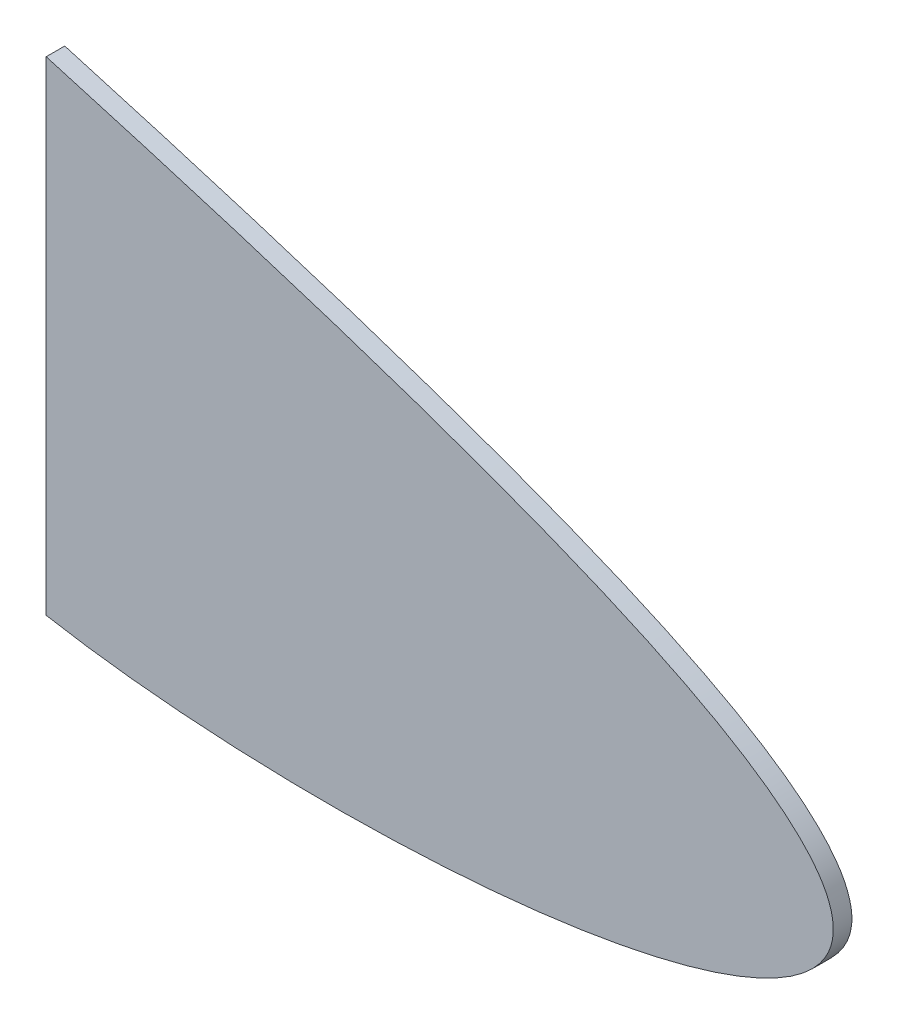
ISO-10303-21;
HEADER;
FILE_DESCRIPTION(('STEP AP214'),'2;1');
FILE_NAME('part.step','',(''),(''),'','','');
FILE_SCHEMA(('AUTOMOTIVE_DESIGN { 1 0 10303 214 1 1 1 1 }'));
ENDSEC;
DATA;
#1=APPLICATION_CONTEXT('core data for automotive mechanical design processes');
#2=APPLICATION_PROTOCOL_DEFINITION('international standard','automotive_design',2000,#1);
#3=PRODUCT_CONTEXT('',#1,'mechanical');
#4=PRODUCT('Part','Part','',(#3));
#5=PRODUCT_RELATED_PRODUCT_CATEGORY('part','',(#4));
#6=PRODUCT_DEFINITION_FORMATION('','',#4);
#7=PRODUCT_DEFINITION_CONTEXT('part definition',#1,'design');
#8=PRODUCT_DEFINITION('design','',#6,#7);
#9=PRODUCT_DEFINITION_SHAPE('','',#8);
#10=(LENGTH_UNIT() NAMED_UNIT(*) SI_UNIT(.MILLI.,.METRE.));
#11=(NAMED_UNIT(*) PLANE_ANGLE_UNIT() SI_UNIT($,.RADIAN.));
#12=(NAMED_UNIT(*) SI_UNIT($,.STERADIAN.) SOLID_ANGLE_UNIT());
#13=UNCERTAINTY_MEASURE_WITH_UNIT(LENGTH_MEASURE(1.E-05),#10,'distance_accuracy_value','');
#14=(GEOMETRIC_REPRESENTATION_CONTEXT(3) GLOBAL_UNCERTAINTY_ASSIGNED_CONTEXT((#13)) GLOBAL_UNIT_ASSIGNED_CONTEXT((#10,
#11,#12)) REPRESENTATION_CONTEXT('',''));
#15=CARTESIAN_POINT('',(0.,0.,0.));
#16=DIRECTION('',(0.,0.,1.));
#17=DIRECTION('',(1.,0.,0.));
#18=AXIS2_PLACEMENT_3D('',#15,#16,#17);
#19=CARTESIAN_POINT('',(10.6379734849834,6.05459948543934,-0.914405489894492));
#20=CARTESIAN_POINT('',(17.6344475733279,4.79148537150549,-0.914405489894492));
#21=CARTESIAN_POINT('',(28.1488490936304,4.79148537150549,-0.914405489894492));
#22=CARTESIAN_POINT('',(40.0870758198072,6.05459948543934,-0.914405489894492));
#23=CARTESIAN_POINT('',(41.9490010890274,10.5963112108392,-0.914405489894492));
#24=CARTESIAN_POINT('',(38.3346755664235,13.9920994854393,-0.914405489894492));
#25=CARTESIAN_POINT('',(10.6379734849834,21.9295994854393,-0.914405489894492));
#26=B_SPLINE_CURVE_WITH_KNOTS('',6,(#19,#20,#21,#22,#23,#24,#25),.UNSPECIFIED.,.F.,.F.,(7,7),
(0.,1.),.UNSPECIFIED.);
#27=DIRECTION('',(0.,0.,1.));
#28=VECTOR('',#27,1.);
#29=SURFACE_OF_LINEAR_EXTRUSION('',#26,#28);
#30=CARTESIAN_POINT('',(10.6379734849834,6.05459948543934,-0.304805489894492));
#31=CARTESIAN_POINT('',(17.6344475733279,4.79148537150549,-0.304805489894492));
#32=CARTESIAN_POINT('',(28.1488490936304,4.79148537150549,-0.304805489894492));
#33=CARTESIAN_POINT('',(40.0870758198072,6.05459948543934,-0.304805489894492));
#34=CARTESIAN_POINT('',(41.9490010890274,10.5963112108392,-0.304805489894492));
#35=CARTESIAN_POINT('',(38.3346755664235,13.9920994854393,-0.304805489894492));
#36=CARTESIAN_POINT('',(10.6379734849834,21.9295994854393,-0.304805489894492));
#37=B_SPLINE_CURVE_WITH_KNOTS('',6,(#30,#31,#32,#33,#34,#35,#36),.UNSPECIFIED.,.F.,.F.,(7,7),
(0.,1.),.UNSPECIFIED.);
#38=CARTESIAN_POINT('',(10.6379734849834,6.05459948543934,-0.304805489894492));
#39=VERTEX_POINT('',#38);
#40=CARTESIAN_POINT('',(10.6379734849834,21.9295994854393,-0.304805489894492));
#41=VERTEX_POINT('',#40);
#42=EDGE_CURVE('E70',#39,#41,#37,.T.);
#43=ORIENTED_EDGE('',*,*,#42,.F.);
#44=DIRECTION('',(0.,0.,1.));
#45=VECTOR('',#44,1.);
#46=CARTESIAN_POINT('',(10.6379734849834,6.05459948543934,-0.914405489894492));
#47=LINE('',#46,#45);
#48=CARTESIAN_POINT('',(10.6379734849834,6.05459948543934,-0.914405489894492));
#49=VERTEX_POINT('',#48);
#50=EDGE_CURVE('E11',#49,#39,#47,.T.);
#51=ORIENTED_EDGE('',*,*,#50,.F.);
#52=CARTESIAN_POINT('',(10.6379734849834,21.9295994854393,-0.914405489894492));
#53=VERTEX_POINT('',#52);
#54=EDGE_CURVE('E74',#49,#53,#26,.T.);
#55=ORIENTED_EDGE('',*,*,#54,.T.);
#56=DIRECTION('',(0.,0.,1.));
#57=VECTOR('',#56,1.);
#58=CARTESIAN_POINT('',(10.6379734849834,21.9295994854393,-0.914405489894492));
#59=LINE('',#58,#57);
#60=EDGE_CURVE('E44',#53,#41,#59,.T.);
#61=ORIENTED_EDGE('',*,*,#60,.T.);
#62=EDGE_LOOP('',(#43,#51,#55,#61));
#63=FACE_BOUND('',#62,.T.);
#64=ADVANCED_FACE('F40',(#63),#29,.T.);
#65=CARTESIAN_POINT('',(10.6379734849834,6.05459948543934,-0.914405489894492));
#66=DIRECTION('',(-1.,0.,0.));
#67=DIRECTION('',(0.,0.,1.));
#68=AXIS2_PLACEMENT_3D('',#65,#66,#67);
#69=PLANE('',#68);
#70=DIRECTION('',(0.,-1.,0.));
#71=VECTOR('',#70,1.);
#72=CARTESIAN_POINT('',(10.6379734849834,6.05459948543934,-0.304805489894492));
#73=LINE('',#72,#71);
#74=EDGE_CURVE('E67',#41,#39,#73,.T.);
#75=ORIENTED_EDGE('',*,*,#74,.F.);
#76=ORIENTED_EDGE('',*,*,#60,.F.);
#77=DIRECTION('',(0.,-1.,0.));
#78=VECTOR('',#77,1.);
#79=CARTESIAN_POINT('',(10.6379734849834,6.05459948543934,-0.914405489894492));
#80=LINE('',#79,#78);
#81=EDGE_CURVE('E69',#53,#49,#80,.T.);
#82=ORIENTED_EDGE('',*,*,#81,.T.);
#83=ORIENTED_EDGE('',*,*,#50,.T.);
#84=EDGE_LOOP('',(#75,#76,#82,#83));
#85=FACE_BOUND('',#84,.T.);
#86=ADVANCED_FACE('F65',(#85),#69,.T.);
#87=CARTESIAN_POINT('',(34.5359367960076,7.69679135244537,-0.914405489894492));
#88=DIRECTION('',(0.,0.,1.));
#89=DIRECTION('',(1.,0.,0.));
#90=AXIS2_PLACEMENT_3D('',#87,#88,#89);
#91=PLANE('',#90);
#92=ORIENTED_EDGE('',*,*,#54,.F.);
#93=ORIENTED_EDGE('',*,*,#81,.F.);
#94=EDGE_LOOP('',(#92,#93));
#95=FACE_BOUND('',#94,.T.);
#96=ADVANCED_FACE('F89',(#95),#91,.F.);
#97=CARTESIAN_POINT('',(34.5359367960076,7.69679135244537,-0.304805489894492));
#98=DIRECTION('',(0.,0.,1.));
#99=DIRECTION('',(1.,0.,0.));
#100=AXIS2_PLACEMENT_3D('',#97,#98,#99);
#101=PLANE('',#100);
#102=ORIENTED_EDGE('',*,*,#42,.T.);
#103=ORIENTED_EDGE('',*,*,#74,.T.);
#104=EDGE_LOOP('',(#102,#103));
#105=FACE_BOUND('',#104,.T.);
#106=ADVANCED_FACE('F73',(#105),#101,.T.);
#107=CLOSED_SHELL('',(#64,#86,#96,#106));
#108=MANIFOLD_SOLID_BREP('B2',#107);
#109=ADVANCED_BREP_SHAPE_REPRESENTATION('',(#18,#108),#14);
#110=SHAPE_DEFINITION_REPRESENTATION(#9,#109);
ENDSEC;
END-ISO-10303-21;
